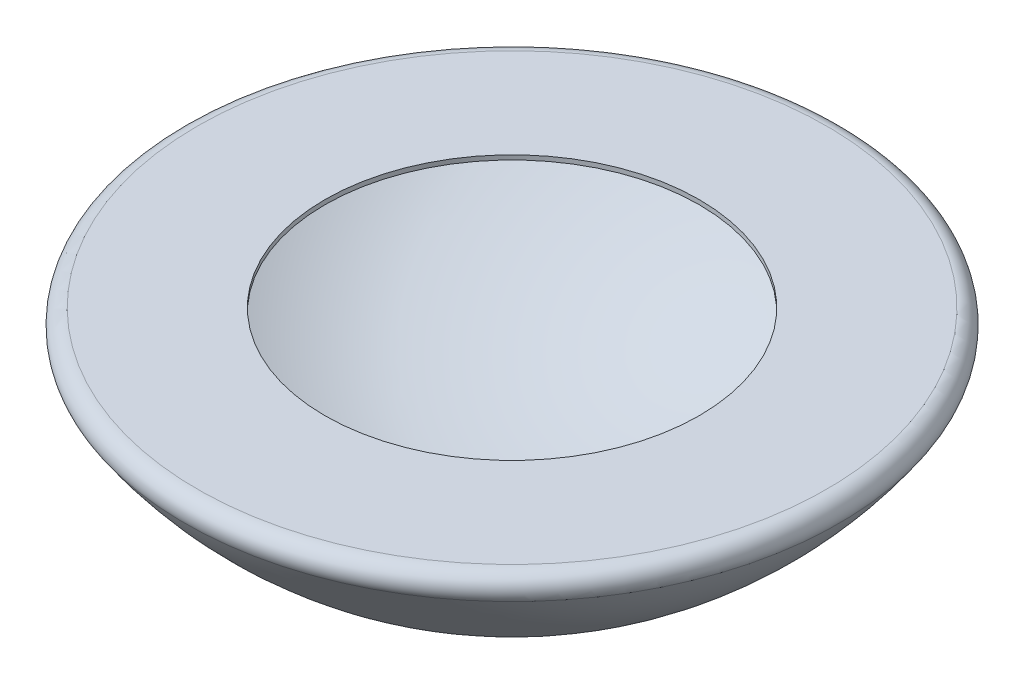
from build123d import *


with BuildPart() as part:
    # Esquisse1 → R_volution2 (revolve)
    with BuildSketch(Plane.XY, mode=Mode.PRIVATE) as r_volution2_sk:
        with BuildLine():
            Line((21, -0.3), (12.495042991, -0.3))
            Line((12.495042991, -0.3), (12.495042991, 0))
            Line((12.495042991, 0), (21, 0))
            ThreePointArc((21, 0), (21.883158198, -0.530924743), (21.828535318, -1.559936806))
            ThreePointArc((21.828535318, -1.559936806), (12.355822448, -10.030567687), (0, -13))
            Line((0, -13), (0, -12.699981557))
            ThreePointArc((0, -12.699981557), (12.215097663, -9.76561618), (21.579974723, -1.391955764))
            ThreePointArc((21.579974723, -1.391955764), (21.618210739, -0.67164732), (21, -0.3))
        make_face()
    revolve(r_volution2_sk.sketch.rotate(Axis((0, 4.280717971, 0), (0, -1, 0)), 180), axis=Axis((0, 4.280717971, 0), (0, -1, 0)))


solid = part.part
